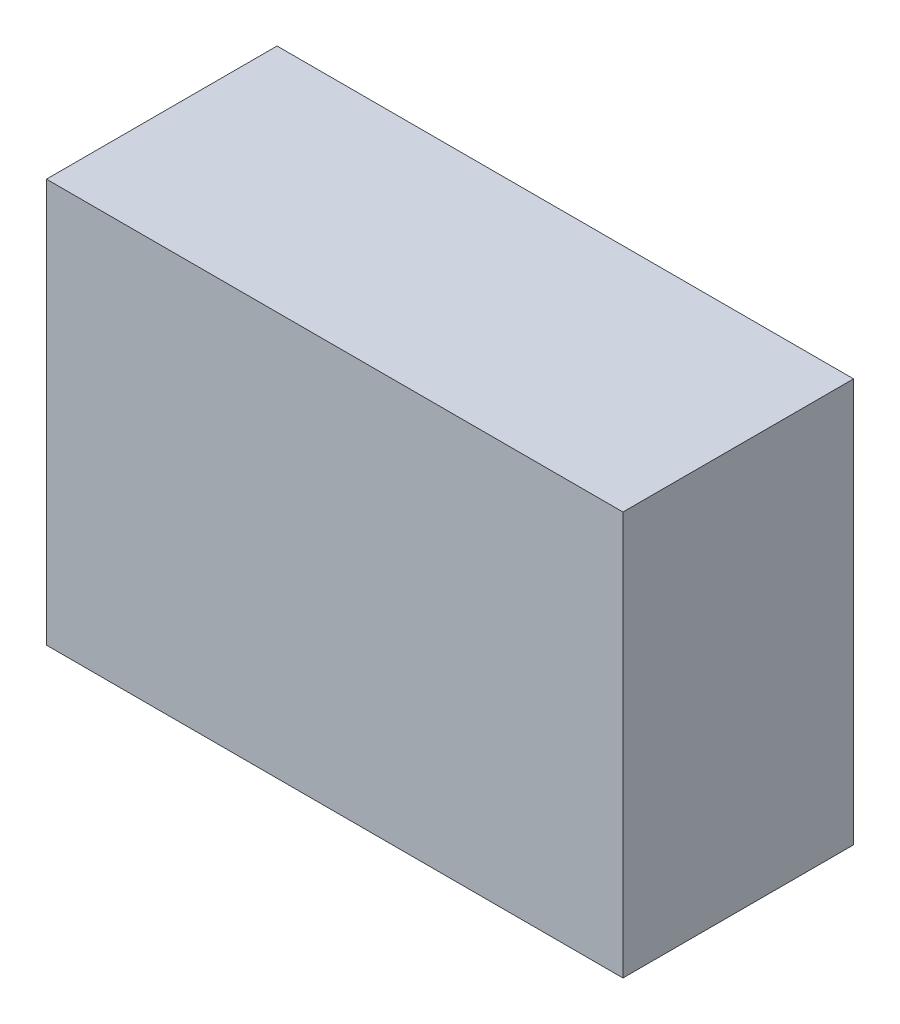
from build123d import *

# Parameters (mm, degrees)
SZKIC1_W                    = 100
SZKIC1_H                    = 70
DODANIE_WYCI_GNI_CIE1_DEPTH = 40
SZKIC2_R                    = 9
WYTNIJ_WYCI_GNI_CIE1_DEPTH  = 35


with BuildPart() as part:
    # Szkic1 → Dodanie-wyci_gni_cie1 (new body)
    with BuildSketch(Plane.XY):
        Rectangle(SZKIC1_W, SZKIC1_H)
    extrude(amount=DODANIE_WYCI_GNI_CIE1_DEPTH)

    # Szkic2 → Wytnij-wyci_gni_cie1 (cut)
    with BuildSketch(Plane.XZ.offset(35)):
        with Locations((-25, 20)):
            Circle(SZKIC2_R)
        with Locations((25, 20)):
            Circle(SZKIC2_R)
    extrude(amount=-WYTNIJ_WYCI_GNI_CIE1_DEPTH, mode=Mode.SUBTRACT)


solid = part.part
